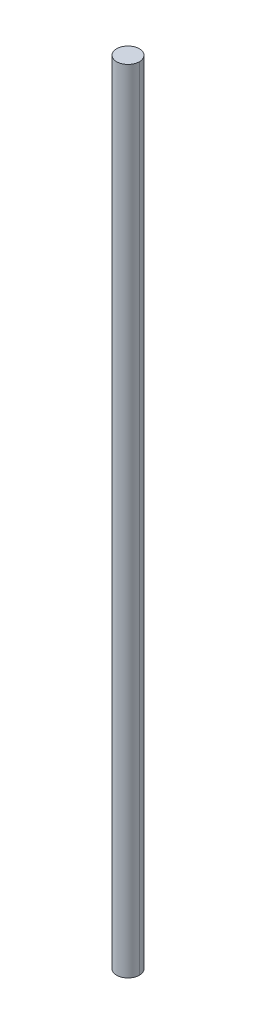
ISO-10303-21;
HEADER;
FILE_DESCRIPTION(('STEP AP214'),'2;1');
FILE_NAME('part.step','',(''),(''),'','','');
FILE_SCHEMA(('AUTOMOTIVE_DESIGN { 1 0 10303 214 1 1 1 1 }'));
ENDSEC;
DATA;
#1=APPLICATION_CONTEXT('core data for automotive mechanical design processes');
#2=APPLICATION_PROTOCOL_DEFINITION('international standard','automotive_design',2000,#1);
#3=PRODUCT_CONTEXT('',#1,'mechanical');
#4=PRODUCT('Part','Part','',(#3));
#5=PRODUCT_RELATED_PRODUCT_CATEGORY('part','',(#4));
#6=PRODUCT_DEFINITION_FORMATION('','',#4);
#7=PRODUCT_DEFINITION_CONTEXT('part definition',#1,'design');
#8=PRODUCT_DEFINITION('design','',#6,#7);
#9=PRODUCT_DEFINITION_SHAPE('','',#8);
#10=(LENGTH_UNIT() NAMED_UNIT(*) SI_UNIT(.MILLI.,.METRE.));
#11=(NAMED_UNIT(*) PLANE_ANGLE_UNIT() SI_UNIT($,.RADIAN.));
#12=(NAMED_UNIT(*) SI_UNIT($,.STERADIAN.) SOLID_ANGLE_UNIT());
#13=UNCERTAINTY_MEASURE_WITH_UNIT(LENGTH_MEASURE(1.E-05),#10,'distance_accuracy_value','');
#14=(GEOMETRIC_REPRESENTATION_CONTEXT(3) GLOBAL_UNCERTAINTY_ASSIGNED_CONTEXT((#13)) GLOBAL_UNIT_ASSIGNED_CONTEXT((#10,
#11,#12)) REPRESENTATION_CONTEXT('',''));
#15=CARTESIAN_POINT('',(0.,0.,0.));
#16=DIRECTION('',(0.,0.,1.));
#17=DIRECTION('',(1.,0.,0.));
#18=AXIS2_PLACEMENT_3D('',#15,#16,#17);
#19=CARTESIAN_POINT('',(0.,222.25,0.));
#20=DIRECTION('',(0.,1.,0.));
#21=DIRECTION('',(0.,0.,1.));
#22=AXIS2_PLACEMENT_3D('',#19,#20,#21);
#23=PLANE('',#22);
#24=CARTESIAN_POINT('',(0.,222.25,0.));
#25=DIRECTION('',(0.,-1.,0.));
#26=DIRECTION('',(0.,0.,-1.));
#27=AXIS2_PLACEMENT_3D('',#24,#25,#26);
#28=CIRCLE('',#27,6.35);
#29=CARTESIAN_POINT('',(-6.35,222.25,0.));
#30=VERTEX_POINT('',#29);
#31=CARTESIAN_POINT('',(6.35,222.25,0.));
#32=VERTEX_POINT('',#31);
#33=EDGE_CURVE('E19',#30,#32,#28,.T.);
#34=ORIENTED_EDGE('',*,*,#33,.F.);
#35=CARTESIAN_POINT('',(0.,222.25,0.));
#36=DIRECTION('',(0.,-1.,0.));
#37=DIRECTION('',(0.,0.,-1.));
#38=AXIS2_PLACEMENT_3D('',#35,#36,#37);
#39=CIRCLE('',#38,6.35);
#40=EDGE_CURVE('E47',#32,#30,#39,.T.);
#41=ORIENTED_EDGE('',*,*,#40,.F.);
#42=EDGE_LOOP('',(#34,#41));
#43=FACE_BOUND('',#42,.T.);
#44=ADVANCED_FACE('F16',(#43),#23,.T.);
#45=CARTESIAN_POINT('',(0.,82.55,0.));
#46=DIRECTION('',(0.,-1.,0.));
#47=DIRECTION('',(0.,0.,-1.));
#48=AXIS2_PLACEMENT_3D('',#45,#46,#47);
#49=CYLINDRICAL_SURFACE('',#48,6.35);
#50=DIRECTION('',(0.,-1.,0.));
#51=VECTOR('',#50,1.);
#52=CARTESIAN_POINT('',(-6.35,82.55,0.));
#53=LINE('',#52,#51);
#54=CARTESIAN_POINT('',(-6.35,-222.25,0.));
#55=VERTEX_POINT('',#54);
#56=EDGE_CURVE('E25',#30,#55,#53,.T.);
#57=ORIENTED_EDGE('',*,*,#56,.F.);
#58=ORIENTED_EDGE('',*,*,#33,.T.);
#59=DIRECTION('',(0.,-1.,0.));
#60=VECTOR('',#59,1.);
#61=CARTESIAN_POINT('',(6.35,82.55,0.));
#62=LINE('',#61,#60);
#63=CARTESIAN_POINT('',(6.35,-222.25,0.));
#64=VERTEX_POINT('',#63);
#65=EDGE_CURVE('E41',#64,#32,#62,.F.);
#66=ORIENTED_EDGE('',*,*,#65,.F.);
#67=CARTESIAN_POINT('',(0.,-222.25,0.));
#68=DIRECTION('',(0.,-1.,0.));
#69=DIRECTION('',(0.,0.,-1.));
#70=AXIS2_PLACEMENT_3D('',#67,#68,#69);
#71=CIRCLE('',#70,6.35);
#72=EDGE_CURVE('E34',#55,#64,#71,.T.);
#73=ORIENTED_EDGE('',*,*,#72,.F.);
#74=EDGE_LOOP('',(#57,#58,#66,#73));
#75=FACE_BOUND('',#74,.T.);
#76=ADVANCED_FACE('F43',(#75),#49,.T.);
#77=CARTESIAN_POINT('',(0.,-222.25,0.));
#78=DIRECTION('',(0.,-1.,0.));
#79=DIRECTION('',(0.,0.,-1.));
#80=AXIS2_PLACEMENT_3D('',#77,#78,#79);
#81=PLANE('',#80);
#82=CARTESIAN_POINT('',(0.,-222.25,0.));
#83=DIRECTION('',(0.,-1.,0.));
#84=DIRECTION('',(0.,0.,-1.));
#85=AXIS2_PLACEMENT_3D('',#82,#83,#84);
#86=CIRCLE('',#85,6.35);
#87=EDGE_CURVE('E11',#55,#64,#86,.F.);
#88=ORIENTED_EDGE('',*,*,#87,.F.);
#89=ORIENTED_EDGE('',*,*,#72,.T.);
#90=EDGE_LOOP('',(#88,#89));
#91=FACE_BOUND('',#90,.T.);
#92=ADVANCED_FACE('F54',(#91),#81,.T.);
#93=CARTESIAN_POINT('',(0.,82.55,0.));
#94=DIRECTION('',(0.,-1.,0.));
#95=DIRECTION('',(0.,0.,-1.));
#96=AXIS2_PLACEMENT_3D('',#93,#94,#95);
#97=CYLINDRICAL_SURFACE('',#96,6.35);
#98=ORIENTED_EDGE('',*,*,#56,.T.);
#99=ORIENTED_EDGE('',*,*,#87,.T.);
#100=ORIENTED_EDGE('',*,*,#65,.T.);
#101=ORIENTED_EDGE('',*,*,#40,.T.);
#102=EDGE_LOOP('',(#98,#99,#100,#101));
#103=FACE_BOUND('',#102,.T.);
#104=ADVANCED_FACE('F50',(#103),#97,.T.);
#105=CLOSED_SHELL('',(#44,#76,#92,#104));
#106=MANIFOLD_SOLID_BREP('B1',#105);
#107=ADVANCED_BREP_SHAPE_REPRESENTATION('',(#18,#106),#14);
#108=SHAPE_DEFINITION_REPRESENTATION(#9,#107);
ENDSEC;
END-ISO-10303-21;
